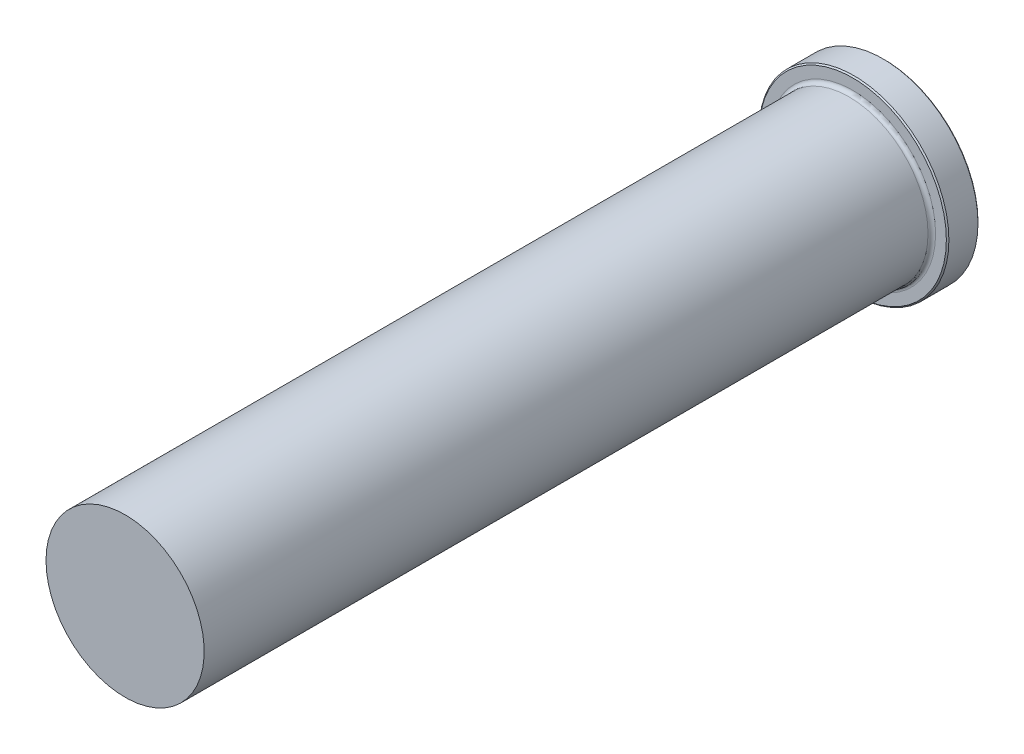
ISO-10303-21;
HEADER;
FILE_DESCRIPTION(('STEP AP214'),'2;1');
FILE_NAME('part.step','',(''),(''),'','','');
FILE_SCHEMA(('AUTOMOTIVE_DESIGN { 1 0 10303 214 1 1 1 1 }'));
ENDSEC;
DATA;
#1=APPLICATION_CONTEXT('core data for automotive mechanical design processes');
#2=APPLICATION_PROTOCOL_DEFINITION('international standard','automotive_design',2000,#1);
#3=PRODUCT_CONTEXT('',#1,'mechanical');
#4=PRODUCT('Part','Part','',(#3));
#5=PRODUCT_RELATED_PRODUCT_CATEGORY('part','',(#4));
#6=PRODUCT_DEFINITION_FORMATION('','',#4);
#7=PRODUCT_DEFINITION_CONTEXT('part definition',#1,'design');
#8=PRODUCT_DEFINITION('design','',#6,#7);
#9=PRODUCT_DEFINITION_SHAPE('','',#8);
#10=(LENGTH_UNIT() NAMED_UNIT(*) SI_UNIT(.MILLI.,.METRE.));
#11=(NAMED_UNIT(*) PLANE_ANGLE_UNIT() SI_UNIT($,.RADIAN.));
#12=(NAMED_UNIT(*) SI_UNIT($,.STERADIAN.) SOLID_ANGLE_UNIT());
#13=UNCERTAINTY_MEASURE_WITH_UNIT(LENGTH_MEASURE(1.E-05),#10,'distance_accuracy_value','');
#14=(GEOMETRIC_REPRESENTATION_CONTEXT(3) GLOBAL_UNCERTAINTY_ASSIGNED_CONTEXT((#13)) GLOBAL_UNIT_ASSIGNED_CONTEXT((#10,
#11,#12)) REPRESENTATION_CONTEXT('',''));
#15=CARTESIAN_POINT('',(0.,0.,0.));
#16=DIRECTION('',(0.,0.,1.));
#17=DIRECTION('',(1.,0.,0.));
#18=AXIS2_PLACEMENT_3D('',#15,#16,#17);
#19=CARTESIAN_POINT('',(0.,0.,0.));
#20=DIRECTION('',(0.,0.,-1.));
#21=DIRECTION('',(-1.,0.,0.));
#22=AXIS2_PLACEMENT_3D('',#19,#20,#21);
#23=PLANE('',#22);
#24=CARTESIAN_POINT('',(0.,0.,0.));
#25=DIRECTION('',(0.,0.,-1.));
#26=DIRECTION('',(-1.,0.,0.));
#27=AXIS2_PLACEMENT_3D('',#24,#25,#26);
#28=CIRCLE('',#27,18.796);
#29=CARTESIAN_POINT('',(-18.796,0.,0.));
#30=VERTEX_POINT('',#29);
#31=EDGE_CURVE('E50',#30,#30,#28,.T.);
#32=ORIENTED_EDGE('',*,*,#31,.T.);
#33=EDGE_LOOP('',(#32));
#34=FACE_BOUND('',#33,.T.);
#35=ADVANCED_FACE('F35',(#34),#23,.T.);
#36=CARTESIAN_POINT('',(0.,0.,0.));
#37=DIRECTION('',(0.,0.,-1.));
#38=DIRECTION('',(-1.,0.,0.));
#39=AXIS2_PLACEMENT_3D('',#36,#37,#38);
#40=CYLINDRICAL_SURFACE('',#39,19.05);
#41=CARTESIAN_POINT('',(0.,0.,0.254000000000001));
#42=DIRECTION('',(0.,0.,-1.));
#43=DIRECTION('',(-1.,0.,0.));
#44=AXIS2_PLACEMENT_3D('',#41,#42,#43);
#45=CIRCLE('',#44,19.05);
#46=CARTESIAN_POINT('',(-19.05,0.,0.254000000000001));
#47=VERTEX_POINT('',#46);
#48=EDGE_CURVE('E42',#47,#47,#45,.F.);
#49=ORIENTED_EDGE('',*,*,#48,.T.);
#50=EDGE_LOOP('',(#49));
#51=FACE_BOUND('',#50,.T.);
#52=CARTESIAN_POINT('',(0.,0.,6.09600000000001));
#53=DIRECTION('',(0.,0.,1.));
#54=DIRECTION('',(1.,0.,0.));
#55=AXIS2_PLACEMENT_3D('',#52,#53,#54);
#56=CIRCLE('',#55,19.05);
#57=CARTESIAN_POINT('',(19.05,0.,6.09600000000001));
#58=VERTEX_POINT('',#57);
#59=EDGE_CURVE('E46',#58,#58,#56,.F.);
#60=ORIENTED_EDGE('',*,*,#59,.T.);
#61=EDGE_LOOP('',(#60));
#62=FACE_BOUND('',#61,.T.);
#63=ADVANCED_FACE('F82',(#51,#62),#40,.T.);
#64=CARTESIAN_POINT('',(0.,19.05,6.35));
#65=DIRECTION('',(0.,0.,1.));
#66=DIRECTION('',(1.,0.,0.));
#67=AXIS2_PLACEMENT_3D('',#64,#65,#66);
#68=PLANE('',#67);
#69=CARTESIAN_POINT('',(0.,0.,6.35));
#70=DIRECTION('',(0.,0.,1.));
#71=DIRECTION('',(1.,0.,0.));
#72=AXIS2_PLACEMENT_3D('',#69,#70,#71);
#73=CIRCLE('',#72,18.796);
#74=CARTESIAN_POINT('',(18.796,0.,6.35));
#75=VERTEX_POINT('',#74);
#76=EDGE_CURVE('E10',#75,#75,#73,.T.);
#77=ORIENTED_EDGE('',*,*,#76,.T.);
#78=EDGE_LOOP('',(#77));
#79=FACE_BOUND('',#78,.T.);
#80=CARTESIAN_POINT('',(0.,0.,6.35));
#81=DIRECTION('',(0.,0.,1.));
#82=DIRECTION('',(1.,0.,0.));
#83=AXIS2_PLACEMENT_3D('',#80,#81,#82);
#84=CIRCLE('',#83,16.637);
#85=CARTESIAN_POINT('',(16.637,0.,6.35));
#86=VERTEX_POINT('',#85);
#87=EDGE_CURVE('E58',#86,#86,#84,.F.);
#88=ORIENTED_EDGE('',*,*,#87,.T.);
#89=EDGE_LOOP('',(#88));
#90=FACE_BOUND('',#89,.T.);
#91=ADVANCED_FACE('F78',(#79,#90),#68,.T.);
#92=CARTESIAN_POINT('',(0.,0.,0.));
#93=DIRECTION('',(0.,0.,-1.));
#94=DIRECTION('',(-1.,0.,0.));
#95=AXIS2_PLACEMENT_3D('',#92,#93,#94);
#96=CYLINDRICAL_SURFACE('',#95,15.875);
#97=CARTESIAN_POINT('',(0.,0.,7.112));
#98=DIRECTION('',(0.,0.,1.));
#99=DIRECTION('',(1.,0.,0.));
#100=AXIS2_PLACEMENT_3D('',#97,#98,#99);
#101=CIRCLE('',#100,15.875);
#102=CARTESIAN_POINT('',(15.875,0.,7.112));
#103=VERTEX_POINT('',#102);
#104=EDGE_CURVE('E55',#103,#103,#101,.T.);
#105=ORIENTED_EDGE('',*,*,#104,.T.);
#106=EDGE_LOOP('',(#105));
#107=FACE_BOUND('',#106,.T.);
#108=CARTESIAN_POINT('',(0.,0.,152.4));
#109=DIRECTION('',(0.,0.,-1.));
#110=DIRECTION('',(-1.,0.,0.));
#111=AXIS2_PLACEMENT_3D('',#108,#109,#110);
#112=CIRCLE('',#111,15.875);
#113=CARTESIAN_POINT('',(-15.875,0.,152.4));
#114=VERTEX_POINT('',#113);
#115=EDGE_CURVE('E61',#114,#114,#112,.T.);
#116=ORIENTED_EDGE('',*,*,#115,.T.);
#117=EDGE_LOOP('',(#116));
#118=FACE_BOUND('',#117,.T.);
#119=ADVANCED_FACE('F65',(#107,#118),#96,.T.);
#120=CARTESIAN_POINT('',(0.,15.875,152.4));
#121=DIRECTION('',(0.,0.,1.));
#122=DIRECTION('',(1.,0.,0.));
#123=AXIS2_PLACEMENT_3D('',#120,#121,#122);
#124=PLANE('',#123);
#125=ORIENTED_EDGE('',*,*,#115,.F.);
#126=EDGE_LOOP('',(#125));
#127=FACE_BOUND('',#126,.T.);
#128=ADVANCED_FACE('F67',(#127),#124,.T.);
#129=CARTESIAN_POINT('',(0.,0.,7.112));
#130=DIRECTION('',(0.,0.,1.));
#131=DIRECTION('',(1.,0.,0.));
#132=AXIS2_PLACEMENT_3D('',#129,#130,#131);
#133=TOROIDAL_SURFACE('',#132,16.637,0.762);
#134=ORIENTED_EDGE('',*,*,#104,.F.);
#135=EDGE_LOOP('',(#134));
#136=FACE_BOUND('',#135,.T.);
#137=ORIENTED_EDGE('',*,*,#87,.F.);
#138=EDGE_LOOP('',(#137));
#139=FACE_BOUND('',#138,.T.);
#140=ADVANCED_FACE('F69',(#136,#139),#133,.F.);
#141=CARTESIAN_POINT('',(0.,0.,0.));
#142=DIRECTION('',(0.,0.,1.));
#143=DIRECTION('',(1.,0.,0.));
#144=AXIS2_PLACEMENT_3D('',#141,#142,#143);
#145=CONICAL_SURFACE('',#144,18.796,0.785398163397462);
#146=ORIENTED_EDGE('',*,*,#48,.F.);
#147=EDGE_LOOP('',(#146));
#148=FACE_BOUND('',#147,.T.);
#149=ORIENTED_EDGE('',*,*,#31,.F.);
#150=EDGE_LOOP('',(#149));
#151=FACE_BOUND('',#150,.T.);
#152=ADVANCED_FACE('F75',(#148,#151),#145,.T.);
#153=CARTESIAN_POINT('',(0.,0.,6.09600000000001));
#154=DIRECTION('',(0.,0.,-1.));
#155=DIRECTION('',(-1.,0.,0.));
#156=AXIS2_PLACEMENT_3D('',#153,#154,#155);
#157=CONICAL_SURFACE('',#156,19.05,0.785398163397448);
#158=ORIENTED_EDGE('',*,*,#76,.F.);
#159=EDGE_LOOP('',(#158));
#160=FACE_BOUND('',#159,.T.);
#161=ORIENTED_EDGE('',*,*,#59,.F.);
#162=EDGE_LOOP('',(#161));
#163=FACE_BOUND('',#162,.T.);
#164=ADVANCED_FACE('F37',(#160,#163),#157,.T.);
#165=CLOSED_SHELL('',(#35,#63,#91,#119,#128,#140,#152,#164));
#166=MANIFOLD_SOLID_BREP('B2',#165);
#167=ADVANCED_BREP_SHAPE_REPRESENTATION('',(#18,#166),#14);
#168=SHAPE_DEFINITION_REPRESENTATION(#9,#167);
ENDSEC;
END-ISO-10303-21;
